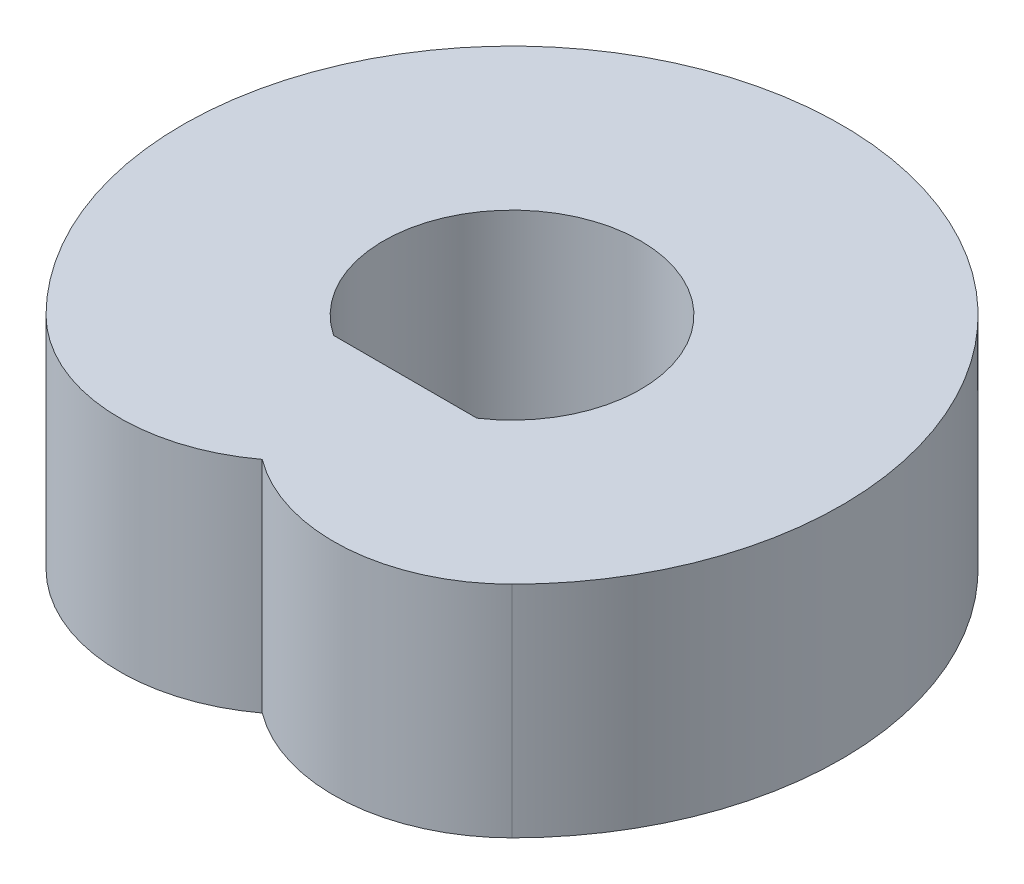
from build123d import *

# Parameters (mm, degrees)
EXTRUDE_1_DEPTH = 400


with BuildPart() as part:
    # Sketch 1 → Extrude 1 (new body)
    with BuildSketch(Plane(origin=(0, 0, 0), x_dir=(1, 0, 0), z_dir=(0, 1, 0))):
        with BuildLine():
            ThreePointArc((424.264068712, -424.264068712), (0, 600), (-424.264068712, -424.264068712))
            ThreePointArc((-424.264068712, -424.264068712), (-217.833180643, -518.612398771), (0, -454.862698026))
            ThreePointArc((0, -454.862698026), (217.833180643, -518.612398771), (424.264068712, -424.264068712))
        make_face()
        with BuildLine():
            Line((130.545635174, -194.454364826), (-130.545635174, -194.454364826))
            ThreePointArc((-130.545635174, -194.454364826), (0, 234.210723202), (130.545635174, -194.454364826))
        make_face(mode=Mode.SUBTRACT)
    extrude(amount=EXTRUDE_1_DEPTH)


solid = part.part
